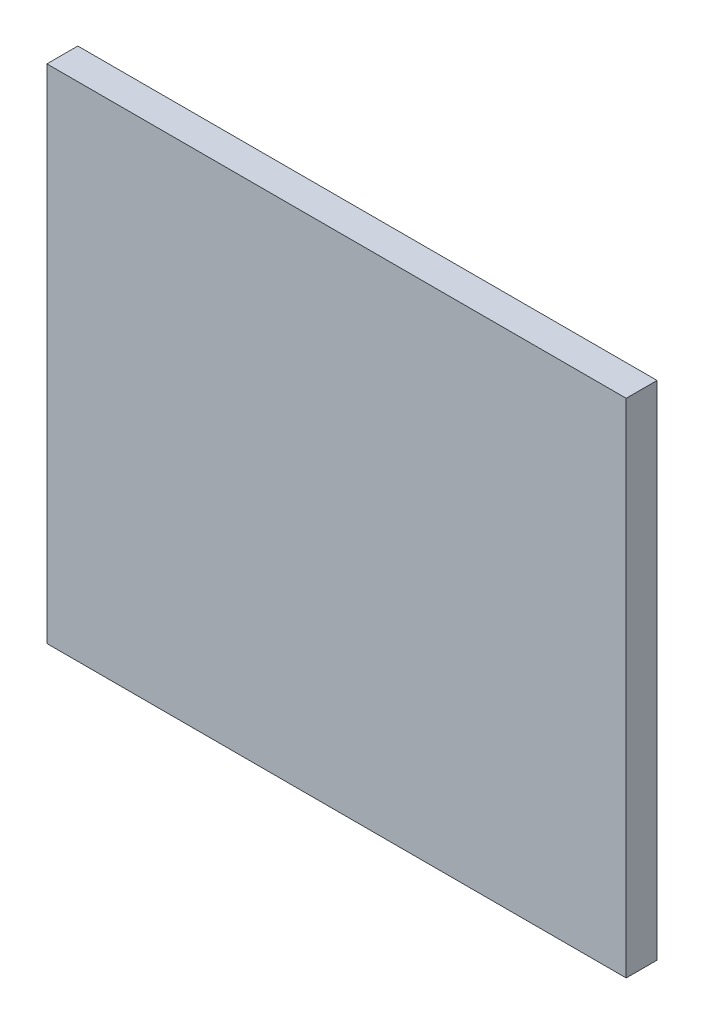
from build123d import *

# Parameters (mm, degrees)
SKETCH_1_W      = 150
SKETCH_1_H      = 130
EXTRUDE_1_DEPTH = 8


with BuildPart() as part:
    # Sketch 1 → Extrude 1 (new body)
    with BuildSketch(Plane.XY):
        with Locations((75, 65)):
            Rectangle(SKETCH_1_W, SKETCH_1_H)
    extrude(amount=EXTRUDE_1_DEPTH)


solid = part.part
